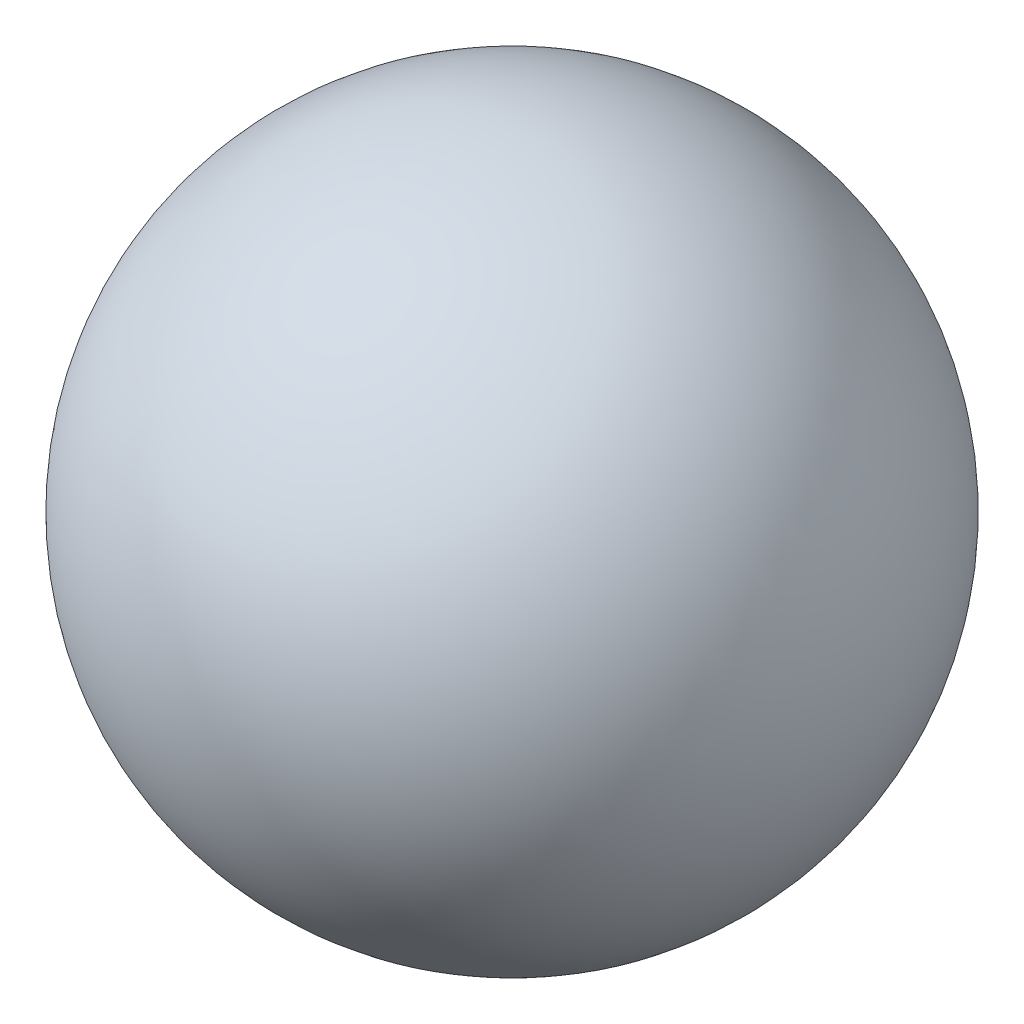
ISO-10303-21;
HEADER;
FILE_DESCRIPTION(('STEP AP214'),'2;1');
FILE_NAME('part.step','',(''),(''),'','','');
FILE_SCHEMA(('AUTOMOTIVE_DESIGN { 1 0 10303 214 1 1 1 1 }'));
ENDSEC;
DATA;
#1=APPLICATION_CONTEXT('core data for automotive mechanical design processes');
#2=APPLICATION_PROTOCOL_DEFINITION('international standard','automotive_design',2000,#1);
#3=PRODUCT_CONTEXT('',#1,'mechanical');
#4=PRODUCT('Part','Part','',(#3));
#5=PRODUCT_RELATED_PRODUCT_CATEGORY('part','',(#4));
#6=PRODUCT_DEFINITION_FORMATION('','',#4);
#7=PRODUCT_DEFINITION_CONTEXT('part definition',#1,'design');
#8=PRODUCT_DEFINITION('design','',#6,#7);
#9=PRODUCT_DEFINITION_SHAPE('','',#8);
#10=(LENGTH_UNIT() NAMED_UNIT(*) SI_UNIT(.MILLI.,.METRE.));
#11=(NAMED_UNIT(*) PLANE_ANGLE_UNIT() SI_UNIT($,.RADIAN.));
#12=(NAMED_UNIT(*) SI_UNIT($,.STERADIAN.) SOLID_ANGLE_UNIT());
#13=UNCERTAINTY_MEASURE_WITH_UNIT(LENGTH_MEASURE(1.E-05),#10,'distance_accuracy_value','');
#14=(GEOMETRIC_REPRESENTATION_CONTEXT(3) GLOBAL_UNCERTAINTY_ASSIGNED_CONTEXT((#13)) GLOBAL_UNIT_ASSIGNED_CONTEXT((#10,
#11,#12)) REPRESENTATION_CONTEXT('',''));
#15=CARTESIAN_POINT('',(0.,0.,0.));
#16=DIRECTION('',(0.,0.,1.));
#17=DIRECTION('',(1.,0.,0.));
#18=AXIS2_PLACEMENT_3D('',#15,#16,#17);
#19=CARTESIAN_POINT('',(0.,0.,0.));
#20=DIRECTION('',(0.,1.,0.));
#21=DIRECTION('',(1.,0.,0.));
#22=AXIS2_PLACEMENT_3D('',#19,#20,#21);
#23=SPHERICAL_SURFACE('',#22,21.3);
#24=CARTESIAN_POINT('',(0.,21.3,0.));
#25=VERTEX_POINT('',#24);
#26=VERTEX_LOOP('',#25);
#27=FACE_BOUND('',#26,.T.);
#28=ADVANCED_FACE('F33',(#27),#23,.T.);
#29=CLOSED_SHELL('',(#28));
#30=MANIFOLD_SOLID_BREP('B2',#29);
#31=ADVANCED_BREP_SHAPE_REPRESENTATION('',(#18,#30),#14);
#32=SHAPE_DEFINITION_REPRESENTATION(#9,#31);
ENDSEC;
END-ISO-10303-21;
